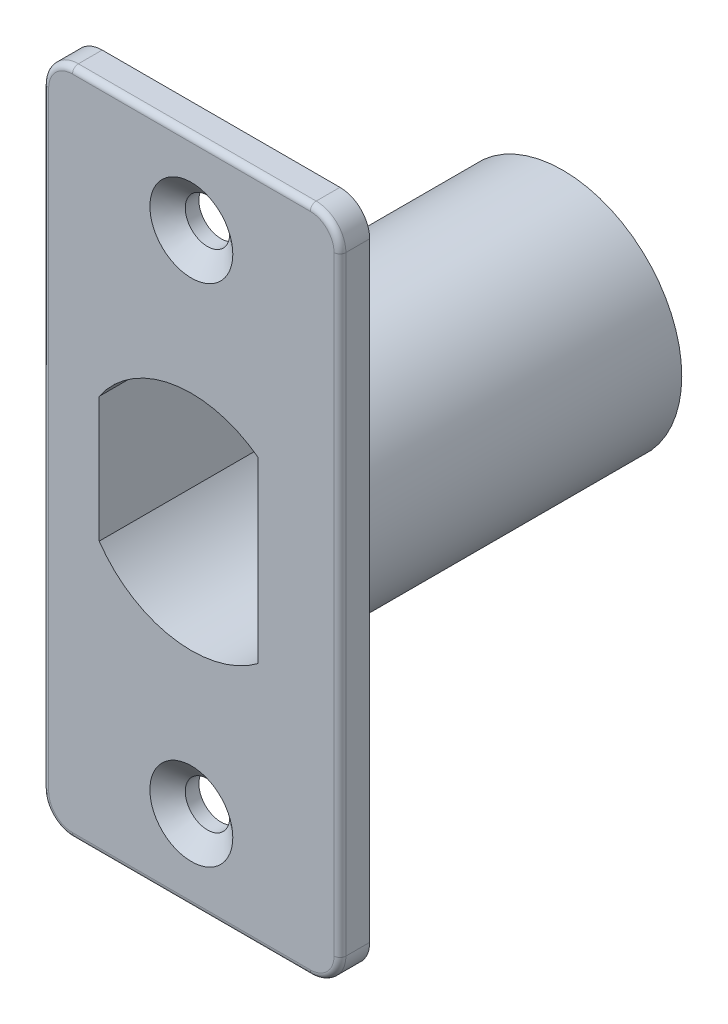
from build123d import *

# Parameters (mm, degrees)
SKETCH1_W                                         = 25.4
SKETCH1_H                                         = 57.15
BOSS_EXTRUDE1_DEPTH                               = 2.54
SKETCH2_R                                         = 10.16
BOSS_EXTRUDE2_DEPTH                               = 31.75
CUT_EXTRUDE1_DEPTH                                = 31.75
CSK_FOR_6_FLAT_HEAD_MACHINE_SCREW_100_D           = 3.7973
CSK_FOR_6_FLAT_HEAD_MACHINE_SCREW_100_CSINK_D     = 7.0866
CSK_FOR_6_FLAT_HEAD_MACHINE_SCREW_100_CSINK_ANGLE = 100
BOSS_EXTRUDE3_START                               = -1.27
BOSS_EXTRUDE3_DEPTH                               = 1.27
FILLET1_R                                         = 2.54
FILLET2_R                                         = 0.508


with BuildPart() as part:
    # Sketch1 → Boss-Extrude1 (new body)
    with BuildSketch(Plane.XY):
        Rectangle(SKETCH1_W, SKETCH1_H)
    extrude(amount=BOSS_EXTRUDE1_DEPTH)

    # Sketch2 → Boss-Extrude2 (add)
    with BuildSketch(Plane.XY.offset(2.54)):
        Circle(SKETCH2_R)
    extrude(amount=-BOSS_EXTRUDE2_DEPTH)

    # Sketch3 → Cut-Extrude1 (cut)
    with BuildSketch(Plane.XY.offset(2.54)):
        with BuildLine():
            Line((-7.874163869, 5.3594), (-7.874163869, -5.3594))
            ThreePointArc((-7.874163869, -5.3594), (-1.563033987, -9.395879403), (5.715, -7.62))
            Line((5.715, -7.62), (5.715, 7.62))
            ThreePointArc((5.715, 7.62), (-1.563033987, 9.395879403), (-7.874163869, 5.3594))
        make_face()
    extrude(amount=-CUT_EXTRUDE1_DEPTH, mode=Mode.SUBTRACT)

    # CSK for _6 Flat Head Machine Screw _100 (through all)
    with Locations(Plane.XY.offset(2.54)):
        with Locations((0, 21.59), (0, -21.59)):
            CounterSinkHole(CSK_FOR_6_FLAT_HEAD_MACHINE_SCREW_100_D / 2, CSK_FOR_6_FLAT_HEAD_MACHINE_SCREW_100_CSINK_D / 2, counter_sink_angle=CSK_FOR_6_FLAT_HEAD_MACHINE_SCREW_100_CSINK_ANGLE)

    # Sketch6 → Boss-Extrude3 (add)
    with BuildSketch(Plane(origin=(0, 0, -29.21), x_dir=(-1, 0, 0), z_dir=(0, 0, -1)).offset(BOSS_EXTRUDE3_START)):
        with BuildLine():
            Line((-5.715, -7.62), (-5.715, 7.62))
            ThreePointArc((-5.715, 7.62), (-3.012069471, 9.036208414), (0, 9.525))
            Line((0, 9.525), (0, -9.525))
            ThreePointArc((0, -9.525), (-3.012069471, -9.036208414), (-5.715, -7.62))
        make_face()
    extrude(amount=BOSS_EXTRUDE3_DEPTH)

    # Fillet1
    fillet1_edges = [part.edges().sort_by_distance(p)[0] for p in [
        (12.7, -28.575, 1.27),
        (-12.7, -28.575, 1.27),
        (-12.7, 28.575, 1.27),
        (12.7, 28.575, 1.27),
    ]]
    fillet(fillet1_edges, radius=FILLET1_R)

    # Fillet2
    fillet2_edges = [part.edges().sort_by_distance(p)[0] for p in [
        (12.7, 0, 2.54),
        (0, -28.575, 2.54),
        (0, 28.575, 2.54),
        (-12.7, 0, 2.54),
        (11.956051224, 27.831051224, 2.54),
        (-11.956051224, 27.831051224, 2.54),
        (-11.956051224, -27.831051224, 2.54),
        (11.956051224, -27.831051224, 2.54),
    ]]
    fillet(fillet2_edges, radius=FILLET2_R)


solid = part.part
